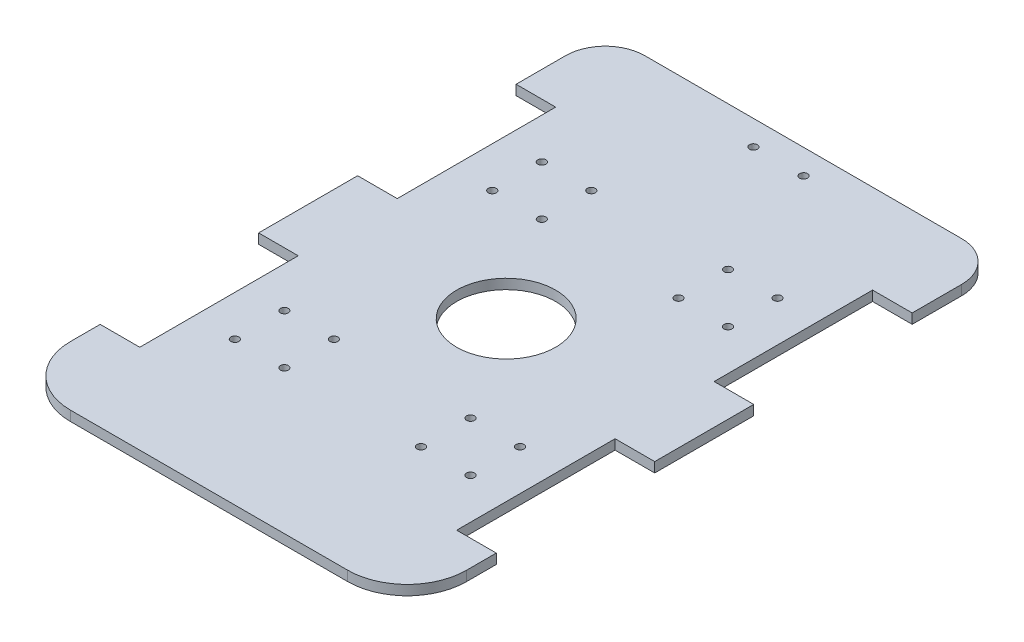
ISO-10303-21;
HEADER;
FILE_DESCRIPTION(('STEP AP214'),'2;1');
FILE_NAME('part.step','',(''),(''),'','','');
FILE_SCHEMA(('AUTOMOTIVE_DESIGN { 1 0 10303 214 1 1 1 1 }'));
ENDSEC;
DATA;
#1=APPLICATION_CONTEXT('core data for automotive mechanical design processes');
#2=APPLICATION_PROTOCOL_DEFINITION('international standard','automotive_design',2000,#1);
#3=PRODUCT_CONTEXT('',#1,'mechanical');
#4=PRODUCT('Part','Part','',(#3));
#5=PRODUCT_RELATED_PRODUCT_CATEGORY('part','',(#4));
#6=PRODUCT_DEFINITION_FORMATION('','',#4);
#7=PRODUCT_DEFINITION_CONTEXT('part definition',#1,'design');
#8=PRODUCT_DEFINITION('design','',#6,#7);
#9=PRODUCT_DEFINITION_SHAPE('','',#8);
#10=(LENGTH_UNIT() NAMED_UNIT(*) SI_UNIT(.MILLI.,.METRE.));
#11=(NAMED_UNIT(*) PLANE_ANGLE_UNIT() SI_UNIT($,.RADIAN.));
#12=(NAMED_UNIT(*) SI_UNIT($,.STERADIAN.) SOLID_ANGLE_UNIT());
#13=UNCERTAINTY_MEASURE_WITH_UNIT(LENGTH_MEASURE(1.E-05),#10,'distance_accuracy_value','');
#14=(GEOMETRIC_REPRESENTATION_CONTEXT(3) GLOBAL_UNCERTAINTY_ASSIGNED_CONTEXT((#13)) GLOBAL_UNIT_ASSIGNED_CONTEXT((#10,
#11,#12)) REPRESENTATION_CONTEXT('',''));
#15=CARTESIAN_POINT('',(0.,0.,0.));
#16=DIRECTION('',(0.,0.,1.));
#17=DIRECTION('',(1.,0.,0.));
#18=AXIS2_PLACEMENT_3D('',#15,#16,#17);
#19=CARTESIAN_POINT('',(70.,5.,120.));
#20=DIRECTION('',(0.,-1.,0.));
#21=DIRECTION('',(0.,0.,-1.));
#22=AXIS2_PLACEMENT_3D('',#19,#20,#21);
#23=PLANE('',#22);
#24=CARTESIAN_POINT('',(70.,5.,120.));
#25=DIRECTION('',(0.,1.,0.));
#26=DIRECTION('',(0.,0.,-1.));
#27=AXIS2_PLACEMENT_3D('',#24,#25,#26);
#28=CIRCLE('',#27,30.);
#29=CARTESIAN_POINT('',(70.0000000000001,5.,150.));
#30=VERTEX_POINT('',#29);
#31=CARTESIAN_POINT('',(100.,5.,120.));
#32=VERTEX_POINT('',#31);
#33=EDGE_CURVE('E274',#30,#32,#28,.T.);
#34=ORIENTED_EDGE('',*,*,#33,.T.);
#35=DIRECTION('',(0.,0.,-1.));
#36=VECTOR('',#35,1.);
#37=CARTESIAN_POINT('',(100.,5.,105.));
#38=LINE('',#37,#36);
#39=CARTESIAN_POINT('',(100.,5.,105.));
#40=VERTEX_POINT('',#39);
#41=EDGE_CURVE('E142',#32,#40,#38,.T.);
#42=ORIENTED_EDGE('',*,*,#41,.T.);
#43=DIRECTION('',(-1.,0.,0.));
#44=VECTOR('',#43,1.);
#45=CARTESIAN_POINT('',(80.,5.,105.));
#46=LINE('',#45,#44);
#47=CARTESIAN_POINT('',(80.,5.,105.));
#48=VERTEX_POINT('',#47);
#49=EDGE_CURVE('E337',#40,#48,#46,.T.);
#50=ORIENTED_EDGE('',*,*,#49,.T.);
#51=DIRECTION('',(0.,0.,-1.));
#52=VECTOR('',#51,1.);
#53=CARTESIAN_POINT('',(80.,5.,24.9999999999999));
#54=LINE('',#53,#52);
#55=CARTESIAN_POINT('',(80.,5.,24.9999999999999));
#56=VERTEX_POINT('',#55);
#57=EDGE_CURVE('E356',#48,#56,#54,.T.);
#58=ORIENTED_EDGE('',*,*,#57,.T.);
#59=DIRECTION('',(1.,0.,0.));
#60=VECTOR('',#59,1.);
#61=CARTESIAN_POINT('',(80.,5.,24.9999999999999));
#62=LINE('',#61,#60);
#63=CARTESIAN_POINT('',(100.,5.,24.9999999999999));
#64=VERTEX_POINT('',#63);
#65=EDGE_CURVE('E353',#56,#64,#62,.T.);
#66=ORIENTED_EDGE('',*,*,#65,.T.);
#67=DIRECTION('',(0.,0.,-1.));
#68=VECTOR('',#67,1.);
#69=CARTESIAN_POINT('',(100.,5.,-25.0000000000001));
#70=LINE('',#69,#68);
#71=CARTESIAN_POINT('',(100.,5.,-25.0000000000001));
#72=VERTEX_POINT('',#71);
#73=EDGE_CURVE('E355',#64,#72,#70,.T.);
#74=ORIENTED_EDGE('',*,*,#73,.T.);
#75=DIRECTION('',(-1.,0.,0.));
#76=VECTOR('',#75,1.);
#77=CARTESIAN_POINT('',(79.9999999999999,5.,-25.0000000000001));
#78=LINE('',#77,#76);
#79=CARTESIAN_POINT('',(79.9999999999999,5.,-25.0000000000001));
#80=VERTEX_POINT('',#79);
#81=EDGE_CURVE('E358',#72,#80,#78,.T.);
#82=ORIENTED_EDGE('',*,*,#81,.T.);
#83=DIRECTION('',(0.,0.,-1.));
#84=VECTOR('',#83,1.);
#85=CARTESIAN_POINT('',(79.9999999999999,5.,-105.));
#86=LINE('',#85,#84);
#87=CARTESIAN_POINT('',(79.9999999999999,5.,-105.));
#88=VERTEX_POINT('',#87);
#89=EDGE_CURVE('E364',#80,#88,#86,.T.);
#90=ORIENTED_EDGE('',*,*,#89,.T.);
#91=DIRECTION('',(1.,0.,0.));
#92=VECTOR('',#91,1.);
#93=CARTESIAN_POINT('',(79.9999999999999,5.,-105.));
#94=LINE('',#93,#92);
#95=CARTESIAN_POINT('',(100.,5.,-105.));
#96=VERTEX_POINT('',#95);
#97=EDGE_CURVE('E366',#88,#96,#94,.T.);
#98=ORIENTED_EDGE('',*,*,#97,.T.);
#99=DIRECTION('',(0.,0.,-1.));
#100=VECTOR('',#99,1.);
#101=CARTESIAN_POINT('',(100.,5.,-130.));
#102=LINE('',#101,#100);
#103=CARTESIAN_POINT('',(100.,5.,-130.));
#104=VERTEX_POINT('',#103);
#105=EDGE_CURVE('E368',#96,#104,#102,.T.);
#106=ORIENTED_EDGE('',*,*,#105,.T.);
#107=CARTESIAN_POINT('',(80.0000000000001,5.,-130.));
#108=DIRECTION('',(0.,1.,0.));
#109=DIRECTION('',(0.,0.,-1.));
#110=AXIS2_PLACEMENT_3D('',#107,#108,#109);
#111=CIRCLE('',#110,20.);
#112=CARTESIAN_POINT('',(80.0000000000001,5.,-150.));
#113=VERTEX_POINT('',#112);
#114=EDGE_CURVE('E370',#104,#113,#111,.T.);
#115=ORIENTED_EDGE('',*,*,#114,.T.);
#116=DIRECTION('',(-1.,0.,0.));
#117=VECTOR('',#116,1.);
#118=CARTESIAN_POINT('',(-80.0000000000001,5.,-150.));
#119=LINE('',#118,#117);
#120=CARTESIAN_POINT('',(-80.0000000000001,5.,-150.));
#121=VERTEX_POINT('',#120);
#122=EDGE_CURVE('E372',#113,#121,#119,.T.);
#123=ORIENTED_EDGE('',*,*,#122,.T.);
#124=CARTESIAN_POINT('',(-80.0000000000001,5.,-130.));
#125=DIRECTION('',(0.,1.,0.));
#126=DIRECTION('',(0.,0.,1.));
#127=AXIS2_PLACEMENT_3D('',#124,#125,#126);
#128=CIRCLE('',#127,20.);
#129=CARTESIAN_POINT('',(-100.,5.,-130.));
#130=VERTEX_POINT('',#129);
#131=EDGE_CURVE('E374',#121,#130,#128,.T.);
#132=ORIENTED_EDGE('',*,*,#131,.T.);
#133=DIRECTION('',(0.,0.,1.));
#134=VECTOR('',#133,1.);
#135=CARTESIAN_POINT('',(-100.,5.,-130.));
#136=LINE('',#135,#134);
#137=CARTESIAN_POINT('',(-100.,5.,-105.));
#138=VERTEX_POINT('',#137);
#139=EDGE_CURVE('E376',#130,#138,#136,.T.);
#140=ORIENTED_EDGE('',*,*,#139,.T.);
#141=DIRECTION('',(1.,0.,0.));
#142=VECTOR('',#141,1.);
#143=CARTESIAN_POINT('',(-79.9999999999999,5.,-105.));
#144=LINE('',#143,#142);
#145=CARTESIAN_POINT('',(-79.9999999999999,5.,-105.));
#146=VERTEX_POINT('',#145);
#147=EDGE_CURVE('E378',#138,#146,#144,.T.);
#148=ORIENTED_EDGE('',*,*,#147,.T.);
#149=DIRECTION('',(0.,0.,1.));
#150=VECTOR('',#149,1.);
#151=CARTESIAN_POINT('',(-79.9999999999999,5.,-105.));
#152=LINE('',#151,#150);
#153=CARTESIAN_POINT('',(-79.9999999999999,5.,-25.0000000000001));
#154=VERTEX_POINT('',#153);
#155=EDGE_CURVE('E380',#146,#154,#152,.T.);
#156=ORIENTED_EDGE('',*,*,#155,.T.);
#157=DIRECTION('',(-1.,0.,0.));
#158=VECTOR('',#157,1.);
#159=CARTESIAN_POINT('',(-79.9999999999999,5.,-25.0000000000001));
#160=LINE('',#159,#158);
#161=CARTESIAN_POINT('',(-100.,5.,-25.0000000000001));
#162=VERTEX_POINT('',#161);
#163=EDGE_CURVE('E382',#154,#162,#160,.T.);
#164=ORIENTED_EDGE('',*,*,#163,.T.);
#165=DIRECTION('',(0.,0.,1.));
#166=VECTOR('',#165,1.);
#167=CARTESIAN_POINT('',(-100.,5.,-25.0000000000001));
#168=LINE('',#167,#166);
#169=CARTESIAN_POINT('',(-100.,5.,24.9999999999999));
#170=VERTEX_POINT('',#169);
#171=EDGE_CURVE('E384',#162,#170,#168,.T.);
#172=ORIENTED_EDGE('',*,*,#171,.T.);
#173=DIRECTION('',(1.,0.,0.));
#174=VECTOR('',#173,1.);
#175=CARTESIAN_POINT('',(-80.,5.,24.9999999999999));
#176=LINE('',#175,#174);
#177=CARTESIAN_POINT('',(-80.,5.,24.9999999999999));
#178=VERTEX_POINT('',#177);
#179=EDGE_CURVE('E386',#170,#178,#176,.T.);
#180=ORIENTED_EDGE('',*,*,#179,.T.);
#181=DIRECTION('',(0.,0.,1.));
#182=VECTOR('',#181,1.);
#183=CARTESIAN_POINT('',(-80.,5.,24.9999999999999));
#184=LINE('',#183,#182);
#185=CARTESIAN_POINT('',(-80.,5.,105.));
#186=VERTEX_POINT('',#185);
#187=EDGE_CURVE('E388',#178,#186,#184,.T.);
#188=ORIENTED_EDGE('',*,*,#187,.T.);
#189=DIRECTION('',(-1.,0.,0.));
#190=VECTOR('',#189,1.);
#191=CARTESIAN_POINT('',(-80.,5.,105.));
#192=LINE('',#191,#190);
#193=CARTESIAN_POINT('',(-100.,5.,105.));
#194=VERTEX_POINT('',#193);
#195=EDGE_CURVE('E209',#186,#194,#192,.T.);
#196=ORIENTED_EDGE('',*,*,#195,.T.);
#197=DIRECTION('',(0.,0.,1.));
#198=VECTOR('',#197,1.);
#199=CARTESIAN_POINT('',(-100.,5.,105.));
#200=LINE('',#199,#198);
#201=CARTESIAN_POINT('',(-100.,5.,120.));
#202=VERTEX_POINT('',#201);
#203=EDGE_CURVE('E203',#194,#202,#200,.T.);
#204=ORIENTED_EDGE('',*,*,#203,.T.);
#205=CARTESIAN_POINT('',(-70.,5.,120.));
#206=DIRECTION('',(0.,1.,0.));
#207=DIRECTION('',(0.,0.,1.));
#208=AXIS2_PLACEMENT_3D('',#205,#206,#207);
#209=CIRCLE('',#208,30.);
#210=CARTESIAN_POINT('',(-70.,5.,150.));
#211=VERTEX_POINT('',#210);
#212=EDGE_CURVE('E207',#202,#211,#209,.T.);
#213=ORIENTED_EDGE('',*,*,#212,.T.);
#214=DIRECTION('',(1.,0.,0.));
#215=VECTOR('',#214,1.);
#216=CARTESIAN_POINT('',(-70.,5.,150.));
#217=LINE('',#216,#215);
#218=EDGE_CURVE('E51',#211,#30,#217,.T.);
#219=ORIENTED_EDGE('',*,*,#218,.T.);
#220=EDGE_LOOP('',(#34,#42,#50,#58,#66,#74,#82,#90,#98,#106,#115,#123,#132,#140,#148,#156,#164,
#172,#180,#188,#196,#204,#213,#219));
#221=FACE_BOUND('',#220,.T.);
#222=CARTESIAN_POINT('',(0.,5.,0.));
#223=DIRECTION('',(0.,1.,0.));
#224=DIRECTION('',(0.,0.,1.));
#225=AXIS2_PLACEMENT_3D('',#222,#223,#224);
#226=CIRCLE('',#225,25.);
#227=CARTESIAN_POINT('',(0.,5.,25.));
#228=VERTEX_POINT('',#227);
#229=EDGE_CURVE('E231',#228,#228,#226,.T.);
#230=ORIENTED_EDGE('',*,*,#229,.F.);
#231=EDGE_LOOP('',(#230));
#232=FACE_BOUND('',#231,.T.);
#233=CARTESIAN_POINT('',(-34.5,5.,-52.5));
#234=DIRECTION('',(0.,1.,0.));
#235=DIRECTION('',(0.,0.,1.));
#236=AXIS2_PLACEMENT_3D('',#233,#234,#235);
#237=CIRCLE('',#236,2.);
#238=CARTESIAN_POINT('',(-34.5,5.,-50.5));
#239=VERTEX_POINT('',#238);
#240=EDGE_CURVE('E602',#239,#239,#237,.T.);
#241=ORIENTED_EDGE('',*,*,#240,.F.);
#242=EDGE_LOOP('',(#241));
#243=FACE_BOUND('',#242,.T.);
#244=CARTESIAN_POINT('',(-59.5,5.,-52.5));
#245=DIRECTION('',(0.,1.,0.));
#246=DIRECTION('',(0.,0.,1.));
#247=AXIS2_PLACEMENT_3D('',#244,#245,#246);
#248=CIRCLE('',#247,2.);
#249=CARTESIAN_POINT('',(-59.5,5.,-50.5));
#250=VERTEX_POINT('',#249);
#251=EDGE_CURVE('E596',#250,#250,#248,.T.);
#252=ORIENTED_EDGE('',*,*,#251,.F.);
#253=EDGE_LOOP('',(#252));
#254=FACE_BOUND('',#253,.T.);
#255=CARTESIAN_POINT('',(-59.5,5.,-77.5));
#256=DIRECTION('',(0.,1.,0.));
#257=DIRECTION('',(0.,0.,1.));
#258=AXIS2_PLACEMENT_3D('',#255,#256,#257);
#259=CIRCLE('',#258,2.);
#260=CARTESIAN_POINT('',(-59.5,5.,-75.5));
#261=VERTEX_POINT('',#260);
#262=EDGE_CURVE('E590',#261,#261,#259,.T.);
#263=ORIENTED_EDGE('',*,*,#262,.F.);
#264=EDGE_LOOP('',(#263));
#265=FACE_BOUND('',#264,.T.);
#266=CARTESIAN_POINT('',(-34.5,5.,-77.5));
#267=DIRECTION('',(0.,1.,0.));
#268=DIRECTION('',(0.,0.,1.));
#269=AXIS2_PLACEMENT_3D('',#266,#267,#268);
#270=CIRCLE('',#269,2.);
#271=CARTESIAN_POINT('',(-34.5,5.,-75.5));
#272=VERTEX_POINT('',#271);
#273=EDGE_CURVE('E584',#272,#272,#270,.T.);
#274=ORIENTED_EDGE('',*,*,#273,.F.);
#275=EDGE_LOOP('',(#274));
#276=FACE_BOUND('',#275,.T.);
#277=CARTESIAN_POINT('',(-59.4999999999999,5.,77.5));
#278=DIRECTION('',(0.,1.,0.));
#279=DIRECTION('',(0.,0.,-1.));
#280=AXIS2_PLACEMENT_3D('',#277,#278,#279);
#281=CIRCLE('',#280,2.);
#282=CARTESIAN_POINT('',(-59.4999999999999,5.,75.5));
#283=VERTEX_POINT('',#282);
#284=EDGE_CURVE('E578',#283,#283,#281,.T.);
#285=ORIENTED_EDGE('',*,*,#284,.F.);
#286=EDGE_LOOP('',(#285));
#287=FACE_BOUND('',#286,.T.);
#288=CARTESIAN_POINT('',(-59.4999999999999,5.,52.5));
#289=DIRECTION('',(0.,1.,0.));
#290=DIRECTION('',(0.,0.,-1.));
#291=AXIS2_PLACEMENT_3D('',#288,#289,#290);
#292=CIRCLE('',#291,2.);
#293=CARTESIAN_POINT('',(-59.4999999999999,5.,50.5));
#294=VERTEX_POINT('',#293);
#295=EDGE_CURVE('E572',#294,#294,#292,.T.);
#296=ORIENTED_EDGE('',*,*,#295,.F.);
#297=EDGE_LOOP('',(#296));
#298=FACE_BOUND('',#297,.T.);
#299=CARTESIAN_POINT('',(-34.4999999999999,5.,52.5));
#300=DIRECTION('',(0.,1.,0.));
#301=DIRECTION('',(0.,0.,-1.));
#302=AXIS2_PLACEMENT_3D('',#299,#300,#301);
#303=CIRCLE('',#302,2.);
#304=CARTESIAN_POINT('',(-34.4999999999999,5.,50.5));
#305=VERTEX_POINT('',#304);
#306=EDGE_CURVE('E566',#305,#305,#303,.T.);
#307=ORIENTED_EDGE('',*,*,#306,.F.);
#308=EDGE_LOOP('',(#307));
#309=FACE_BOUND('',#308,.T.);
#310=CARTESIAN_POINT('',(-34.4999999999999,5.,77.5));
#311=DIRECTION('',(0.,1.,0.));
#312=DIRECTION('',(0.,0.,-1.));
#313=AXIS2_PLACEMENT_3D('',#310,#311,#312);
#314=CIRCLE('',#313,2.);
#315=CARTESIAN_POINT('',(-34.4999999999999,5.,75.5));
#316=VERTEX_POINT('',#315);
#317=EDGE_CURVE('E560',#316,#316,#314,.T.);
#318=ORIENTED_EDGE('',*,*,#317,.F.);
#319=EDGE_LOOP('',(#318));
#320=FACE_BOUND('',#319,.T.);
#321=CARTESIAN_POINT('',(59.5,5.,-77.5));
#322=DIRECTION('',(0.,1.,0.));
#323=DIRECTION('',(0.,0.,-1.));
#324=AXIS2_PLACEMENT_3D('',#321,#322,#323);
#325=CIRCLE('',#324,2.);
#326=CARTESIAN_POINT('',(59.5,5.,-79.5));
#327=VERTEX_POINT('',#326);
#328=EDGE_CURVE('E554',#327,#327,#325,.T.);
#329=ORIENTED_EDGE('',*,*,#328,.F.);
#330=EDGE_LOOP('',(#329));
#331=FACE_BOUND('',#330,.T.);
#332=CARTESIAN_POINT('',(59.5,5.,-52.5));
#333=DIRECTION('',(0.,1.,0.));
#334=DIRECTION('',(0.,0.,-1.));
#335=AXIS2_PLACEMENT_3D('',#332,#333,#334);
#336=CIRCLE('',#335,2.);
#337=CARTESIAN_POINT('',(59.5,5.,-54.5));
#338=VERTEX_POINT('',#337);
#339=EDGE_CURVE('E548',#338,#338,#336,.T.);
#340=ORIENTED_EDGE('',*,*,#339,.F.);
#341=EDGE_LOOP('',(#340));
#342=FACE_BOUND('',#341,.T.);
#343=CARTESIAN_POINT('',(34.5,5.,-77.5));
#344=DIRECTION('',(0.,1.,0.));
#345=DIRECTION('',(0.,0.,-1.));
#346=AXIS2_PLACEMENT_3D('',#343,#344,#345);
#347=CIRCLE('',#346,2.);
#348=CARTESIAN_POINT('',(34.5,5.,-79.5));
#349=VERTEX_POINT('',#348);
#350=EDGE_CURVE('E542',#349,#349,#347,.T.);
#351=ORIENTED_EDGE('',*,*,#350,.F.);
#352=EDGE_LOOP('',(#351));
#353=FACE_BOUND('',#352,.T.);
#354=CARTESIAN_POINT('',(34.5,5.,-52.5));
#355=DIRECTION('',(0.,1.,0.));
#356=DIRECTION('',(0.,0.,-1.));
#357=AXIS2_PLACEMENT_3D('',#354,#355,#356);
#358=CIRCLE('',#357,2.);
#359=CARTESIAN_POINT('',(34.5,5.,-54.5));
#360=VERTEX_POINT('',#359);
#361=EDGE_CURVE('E536',#360,#360,#358,.T.);
#362=ORIENTED_EDGE('',*,*,#361,.F.);
#363=EDGE_LOOP('',(#362));
#364=FACE_BOUND('',#363,.T.);
#365=CARTESIAN_POINT('',(59.4999999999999,5.,52.5));
#366=DIRECTION('',(0.,1.,0.));
#367=DIRECTION('',(0.,0.,1.));
#368=AXIS2_PLACEMENT_3D('',#365,#366,#367);
#369=CIRCLE('',#368,2.);
#370=CARTESIAN_POINT('',(59.4999999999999,5.,54.5));
#371=VERTEX_POINT('',#370);
#372=EDGE_CURVE('E530',#371,#371,#369,.T.);
#373=ORIENTED_EDGE('',*,*,#372,.F.);
#374=EDGE_LOOP('',(#373));
#375=FACE_BOUND('',#374,.T.);
#376=CARTESIAN_POINT('',(59.4999999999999,5.,77.5));
#377=DIRECTION('',(0.,1.,0.));
#378=DIRECTION('',(0.,0.,1.));
#379=AXIS2_PLACEMENT_3D('',#376,#377,#378);
#380=CIRCLE('',#379,2.);
#381=CARTESIAN_POINT('',(59.4999999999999,5.,79.5));
#382=VERTEX_POINT('',#381);
#383=EDGE_CURVE('E524',#382,#382,#380,.T.);
#384=ORIENTED_EDGE('',*,*,#383,.F.);
#385=EDGE_LOOP('',(#384));
#386=FACE_BOUND('',#385,.T.);
#387=CARTESIAN_POINT('',(34.4999999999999,5.,52.5));
#388=DIRECTION('',(0.,1.,0.));
#389=DIRECTION('',(0.,0.,1.));
#390=AXIS2_PLACEMENT_3D('',#387,#388,#389);
#391=CIRCLE('',#390,2.);
#392=CARTESIAN_POINT('',(34.4999999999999,5.,54.5));
#393=VERTEX_POINT('',#392);
#394=EDGE_CURVE('E518',#393,#393,#391,.T.);
#395=ORIENTED_EDGE('',*,*,#394,.F.);
#396=EDGE_LOOP('',(#395));
#397=FACE_BOUND('',#396,.T.);
#398=CARTESIAN_POINT('',(34.4999999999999,5.,77.5));
#399=DIRECTION('',(0.,1.,0.));
#400=DIRECTION('',(0.,0.,1.));
#401=AXIS2_PLACEMENT_3D('',#398,#399,#400);
#402=CIRCLE('',#401,2.);
#403=CARTESIAN_POINT('',(34.4999999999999,5.,79.5));
#404=VERTEX_POINT('',#403);
#405=EDGE_CURVE('E512',#404,#404,#402,.T.);
#406=ORIENTED_EDGE('',*,*,#405,.F.);
#407=EDGE_LOOP('',(#406));
#408=FACE_BOUND('',#407,.T.);
#409=CARTESIAN_POINT('',(12.656835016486,5.,-137.497440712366));
#410=DIRECTION('',(0.,1.,0.));
#411=DIRECTION('',(0.,0.,1.));
#412=AXIS2_PLACEMENT_3D('',#409,#410,#411);
#413=CIRCLE('',#412,2.);
#414=CARTESIAN_POINT('',(12.656835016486,5.,-135.497440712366));
#415=VERTEX_POINT('',#414);
#416=EDGE_CURVE('E506',#415,#415,#413,.T.);
#417=ORIENTED_EDGE('',*,*,#416,.F.);
#418=EDGE_LOOP('',(#417));
#419=FACE_BOUND('',#418,.T.);
#420=CARTESIAN_POINT('',(-12.656835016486,5.,-137.497440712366));
#421=DIRECTION('',(0.,1.,0.));
#422=DIRECTION('',(0.,0.,1.));
#423=AXIS2_PLACEMENT_3D('',#420,#421,#422);
#424=CIRCLE('',#423,2.);
#425=CARTESIAN_POINT('',(-12.656835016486,5.,-135.497440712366));
#426=VERTEX_POINT('',#425);
#427=EDGE_CURVE('E497',#426,#426,#424,.T.);
#428=ORIENTED_EDGE('',*,*,#427,.F.);
#429=EDGE_LOOP('',(#428));
#430=FACE_BOUND('',#429,.T.);
#431=ADVANCED_FACE('F34',(#221,#232,#243,#254,#265,#276,#287,#298,#309,#320,#331,#342,#353,#364,
#375,#386,#397,#408,#419,#430),#23,.F.);
#432=CARTESIAN_POINT('',(70.,0.,120.));
#433=DIRECTION('',(0.,-1.,0.));
#434=DIRECTION('',(0.,0.,-1.));
#435=AXIS2_PLACEMENT_3D('',#432,#433,#434);
#436=PLANE('',#435);
#437=CARTESIAN_POINT('',(12.656835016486,0.,-137.497440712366));
#438=DIRECTION('',(0.,1.,0.));
#439=DIRECTION('',(0.,0.,1.));
#440=AXIS2_PLACEMENT_3D('',#437,#438,#439);
#441=CIRCLE('',#440,2.);
#442=CARTESIAN_POINT('',(12.656835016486,0.,-135.497440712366));
#443=VERTEX_POINT('',#442);
#444=EDGE_CURVE('E503',#443,#443,#441,.T.);
#445=ORIENTED_EDGE('',*,*,#444,.T.);
#446=EDGE_LOOP('',(#445));
#447=FACE_BOUND('',#446,.T.);
#448=CARTESIAN_POINT('',(34.4999999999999,0.,52.5));
#449=DIRECTION('',(0.,1.,0.));
#450=DIRECTION('',(0.,0.,1.));
#451=AXIS2_PLACEMENT_3D('',#448,#449,#450);
#452=CIRCLE('',#451,2.);
#453=CARTESIAN_POINT('',(34.4999999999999,0.,54.5));
#454=VERTEX_POINT('',#453);
#455=EDGE_CURVE('E515',#454,#454,#452,.T.);
#456=ORIENTED_EDGE('',*,*,#455,.T.);
#457=EDGE_LOOP('',(#456));
#458=FACE_BOUND('',#457,.T.);
#459=CARTESIAN_POINT('',(59.4999999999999,0.,52.5));
#460=DIRECTION('',(0.,1.,0.));
#461=DIRECTION('',(0.,0.,1.));
#462=AXIS2_PLACEMENT_3D('',#459,#460,#461);
#463=CIRCLE('',#462,2.);
#464=CARTESIAN_POINT('',(59.4999999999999,0.,54.5));
#465=VERTEX_POINT('',#464);
#466=EDGE_CURVE('E527',#465,#465,#463,.T.);
#467=ORIENTED_EDGE('',*,*,#466,.T.);
#468=EDGE_LOOP('',(#467));
#469=FACE_BOUND('',#468,.T.);
#470=CARTESIAN_POINT('',(34.5,0.,-77.5));
#471=DIRECTION('',(0.,1.,0.));
#472=DIRECTION('',(0.,0.,-1.));
#473=AXIS2_PLACEMENT_3D('',#470,#471,#472);
#474=CIRCLE('',#473,2.);
#475=CARTESIAN_POINT('',(34.5,0.,-79.5));
#476=VERTEX_POINT('',#475);
#477=EDGE_CURVE('E539',#476,#476,#474,.T.);
#478=ORIENTED_EDGE('',*,*,#477,.T.);
#479=EDGE_LOOP('',(#478));
#480=FACE_BOUND('',#479,.T.);
#481=CARTESIAN_POINT('',(59.5,0.,-77.5));
#482=DIRECTION('',(0.,1.,0.));
#483=DIRECTION('',(0.,0.,-1.));
#484=AXIS2_PLACEMENT_3D('',#481,#482,#483);
#485=CIRCLE('',#484,2.);
#486=CARTESIAN_POINT('',(59.5,0.,-79.5));
#487=VERTEX_POINT('',#486);
#488=EDGE_CURVE('E551',#487,#487,#485,.T.);
#489=ORIENTED_EDGE('',*,*,#488,.T.);
#490=EDGE_LOOP('',(#489));
#491=FACE_BOUND('',#490,.T.);
#492=CARTESIAN_POINT('',(-34.4999999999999,0.,52.5));
#493=DIRECTION('',(0.,1.,0.));
#494=DIRECTION('',(0.,0.,-1.));
#495=AXIS2_PLACEMENT_3D('',#492,#493,#494);
#496=CIRCLE('',#495,2.);
#497=CARTESIAN_POINT('',(-34.4999999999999,0.,50.5));
#498=VERTEX_POINT('',#497);
#499=EDGE_CURVE('E563',#498,#498,#496,.T.);
#500=ORIENTED_EDGE('',*,*,#499,.T.);
#501=EDGE_LOOP('',(#500));
#502=FACE_BOUND('',#501,.T.);
#503=CARTESIAN_POINT('',(-59.4999999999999,0.,77.5));
#504=DIRECTION('',(0.,1.,0.));
#505=DIRECTION('',(0.,0.,-1.));
#506=AXIS2_PLACEMENT_3D('',#503,#504,#505);
#507=CIRCLE('',#506,2.);
#508=CARTESIAN_POINT('',(-59.4999999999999,0.,75.5));
#509=VERTEX_POINT('',#508);
#510=EDGE_CURVE('E575',#509,#509,#507,.T.);
#511=ORIENTED_EDGE('',*,*,#510,.T.);
#512=EDGE_LOOP('',(#511));
#513=FACE_BOUND('',#512,.T.);
#514=CARTESIAN_POINT('',(-59.5,0.,-77.5));
#515=DIRECTION('',(0.,1.,0.));
#516=DIRECTION('',(0.,0.,1.));
#517=AXIS2_PLACEMENT_3D('',#514,#515,#516);
#518=CIRCLE('',#517,2.);
#519=CARTESIAN_POINT('',(-59.5,0.,-75.5));
#520=VERTEX_POINT('',#519);
#521=EDGE_CURVE('E587',#520,#520,#518,.T.);
#522=ORIENTED_EDGE('',*,*,#521,.T.);
#523=EDGE_LOOP('',(#522));
#524=FACE_BOUND('',#523,.T.);
#525=CARTESIAN_POINT('',(-34.5,0.,-52.5));
#526=DIRECTION('',(0.,1.,0.));
#527=DIRECTION('',(0.,0.,1.));
#528=AXIS2_PLACEMENT_3D('',#525,#526,#527);
#529=CIRCLE('',#528,2.);
#530=CARTESIAN_POINT('',(-34.5,0.,-50.5));
#531=VERTEX_POINT('',#530);
#532=EDGE_CURVE('E599',#531,#531,#529,.T.);
#533=ORIENTED_EDGE('',*,*,#532,.T.);
#534=EDGE_LOOP('',(#533));
#535=FACE_BOUND('',#534,.T.);
#536=CARTESIAN_POINT('',(70.,0.,120.));
#537=DIRECTION('',(0.,1.,0.));
#538=DIRECTION('',(0.,0.,-1.));
#539=AXIS2_PLACEMENT_3D('',#536,#537,#538);
#540=CIRCLE('',#539,30.);
#541=CARTESIAN_POINT('',(70.0000000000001,0.,150.));
#542=VERTEX_POINT('',#541);
#543=CARTESIAN_POINT('',(100.,0.,120.));
#544=VERTEX_POINT('',#543);
#545=EDGE_CURVE('E227',#542,#544,#540,.T.);
#546=ORIENTED_EDGE('',*,*,#545,.F.);
#547=DIRECTION('',(1.,0.,0.));
#548=VECTOR('',#547,1.);
#549=CARTESIAN_POINT('',(-70.,0.,150.));
#550=LINE('',#549,#548);
#551=CARTESIAN_POINT('',(-70.,0.,150.));
#552=VERTEX_POINT('',#551);
#553=EDGE_CURVE('E134',#552,#542,#550,.T.);
#554=ORIENTED_EDGE('',*,*,#553,.F.);
#555=CARTESIAN_POINT('',(-70.,0.,120.));
#556=DIRECTION('',(0.,1.,0.));
#557=DIRECTION('',(0.,0.,1.));
#558=AXIS2_PLACEMENT_3D('',#555,#556,#557);
#559=CIRCLE('',#558,30.);
#560=CARTESIAN_POINT('',(-100.,0.,120.));
#561=VERTEX_POINT('',#560);
#562=EDGE_CURVE('E128',#561,#552,#559,.T.);
#563=ORIENTED_EDGE('',*,*,#562,.F.);
#564=DIRECTION('',(0.,0.,1.));
#565=VECTOR('',#564,1.);
#566=CARTESIAN_POINT('',(-100.,0.,105.));
#567=LINE('',#566,#565);
#568=CARTESIAN_POINT('',(-100.,0.,105.));
#569=VERTEX_POINT('',#568);
#570=EDGE_CURVE('E217',#569,#561,#567,.T.);
#571=ORIENTED_EDGE('',*,*,#570,.F.);
#572=DIRECTION('',(-1.,0.,0.));
#573=VECTOR('',#572,1.);
#574=CARTESIAN_POINT('',(-80.,0.,105.));
#575=LINE('',#574,#573);
#576=CARTESIAN_POINT('',(-80.,0.,105.));
#577=VERTEX_POINT('',#576);
#578=EDGE_CURVE('E269',#577,#569,#575,.T.);
#579=ORIENTED_EDGE('',*,*,#578,.F.);
#580=DIRECTION('',(0.,0.,1.));
#581=VECTOR('',#580,1.);
#582=CARTESIAN_POINT('',(-80.,0.,24.9999999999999));
#583=LINE('',#582,#581);
#584=CARTESIAN_POINT('',(-80.,0.,24.9999999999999));
#585=VERTEX_POINT('',#584);
#586=EDGE_CURVE('E267',#585,#577,#583,.T.);
#587=ORIENTED_EDGE('',*,*,#586,.F.);
#588=DIRECTION('',(1.,0.,0.));
#589=VECTOR('',#588,1.);
#590=CARTESIAN_POINT('',(-80.,0.,24.9999999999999));
#591=LINE('',#590,#589);
#592=CARTESIAN_POINT('',(-100.,0.,24.9999999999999));
#593=VERTEX_POINT('',#592);
#594=EDGE_CURVE('E265',#593,#585,#591,.T.);
#595=ORIENTED_EDGE('',*,*,#594,.F.);
#596=DIRECTION('',(0.,0.,1.));
#597=VECTOR('',#596,1.);
#598=CARTESIAN_POINT('',(-100.,0.,-25.0000000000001));
#599=LINE('',#598,#597);
#600=CARTESIAN_POINT('',(-100.,0.,-25.0000000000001));
#601=VERTEX_POINT('',#600);
#602=EDGE_CURVE('E263',#601,#593,#599,.T.);
#603=ORIENTED_EDGE('',*,*,#602,.F.);
#604=DIRECTION('',(-1.,0.,0.));
#605=VECTOR('',#604,1.);
#606=CARTESIAN_POINT('',(-79.9999999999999,0.,-25.0000000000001));
#607=LINE('',#606,#605);
#608=CARTESIAN_POINT('',(-79.9999999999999,0.,-25.0000000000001));
#609=VERTEX_POINT('',#608);
#610=EDGE_CURVE('E261',#609,#601,#607,.T.);
#611=ORIENTED_EDGE('',*,*,#610,.F.);
#612=DIRECTION('',(0.,0.,1.));
#613=VECTOR('',#612,1.);
#614=CARTESIAN_POINT('',(-79.9999999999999,0.,-105.));
#615=LINE('',#614,#613);
#616=CARTESIAN_POINT('',(-79.9999999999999,0.,-105.));
#617=VERTEX_POINT('',#616);
#618=EDGE_CURVE('E259',#617,#609,#615,.T.);
#619=ORIENTED_EDGE('',*,*,#618,.F.);
#620=DIRECTION('',(1.,0.,0.));
#621=VECTOR('',#620,1.);
#622=CARTESIAN_POINT('',(-79.9999999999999,0.,-105.));
#623=LINE('',#622,#621);
#624=CARTESIAN_POINT('',(-100.,0.,-105.));
#625=VERTEX_POINT('',#624);
#626=EDGE_CURVE('E257',#625,#617,#623,.T.);
#627=ORIENTED_EDGE('',*,*,#626,.F.);
#628=DIRECTION('',(0.,0.,1.));
#629=VECTOR('',#628,1.);
#630=CARTESIAN_POINT('',(-100.,0.,-130.));
#631=LINE('',#630,#629);
#632=CARTESIAN_POINT('',(-100.,0.,-130.));
#633=VERTEX_POINT('',#632);
#634=EDGE_CURVE('E255',#633,#625,#631,.T.);
#635=ORIENTED_EDGE('',*,*,#634,.F.);
#636=CARTESIAN_POINT('',(-80.0000000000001,0.,-130.));
#637=DIRECTION('',(0.,1.,0.));
#638=DIRECTION('',(0.,0.,1.));
#639=AXIS2_PLACEMENT_3D('',#636,#637,#638);
#640=CIRCLE('',#639,20.);
#641=CARTESIAN_POINT('',(-80.0000000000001,0.,-150.));
#642=VERTEX_POINT('',#641);
#643=EDGE_CURVE('E253',#642,#633,#640,.T.);
#644=ORIENTED_EDGE('',*,*,#643,.F.);
#645=DIRECTION('',(-1.,0.,0.));
#646=VECTOR('',#645,1.);
#647=CARTESIAN_POINT('',(-80.0000000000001,0.,-150.));
#648=LINE('',#647,#646);
#649=CARTESIAN_POINT('',(80.0000000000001,0.,-150.));
#650=VERTEX_POINT('',#649);
#651=EDGE_CURVE('E251',#650,#642,#648,.T.);
#652=ORIENTED_EDGE('',*,*,#651,.F.);
#653=CARTESIAN_POINT('',(80.0000000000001,0.,-130.));
#654=DIRECTION('',(0.,1.,0.));
#655=DIRECTION('',(0.,0.,-1.));
#656=AXIS2_PLACEMENT_3D('',#653,#654,#655);
#657=CIRCLE('',#656,20.);
#658=CARTESIAN_POINT('',(100.,0.,-130.));
#659=VERTEX_POINT('',#658);
#660=EDGE_CURVE('E249',#659,#650,#657,.T.);
#661=ORIENTED_EDGE('',*,*,#660,.F.);
#662=DIRECTION('',(0.,0.,-1.));
#663=VECTOR('',#662,1.);
#664=CARTESIAN_POINT('',(100.,0.,-130.));
#665=LINE('',#664,#663);
#666=CARTESIAN_POINT('',(100.,0.,-105.));
#667=VERTEX_POINT('',#666);
#668=EDGE_CURVE('E247',#667,#659,#665,.T.);
#669=ORIENTED_EDGE('',*,*,#668,.F.);
#670=DIRECTION('',(1.,0.,0.));
#671=VECTOR('',#670,1.);
#672=CARTESIAN_POINT('',(79.9999999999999,0.,-105.));
#673=LINE('',#672,#671);
#674=CARTESIAN_POINT('',(79.9999999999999,0.,-105.));
#675=VERTEX_POINT('',#674);
#676=EDGE_CURVE('E245',#675,#667,#673,.T.);
#677=ORIENTED_EDGE('',*,*,#676,.F.);
#678=DIRECTION('',(0.,0.,-1.));
#679=VECTOR('',#678,1.);
#680=CARTESIAN_POINT('',(79.9999999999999,0.,-105.));
#681=LINE('',#680,#679);
#682=CARTESIAN_POINT('',(79.9999999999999,0.,-25.0000000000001));
#683=VERTEX_POINT('',#682);
#684=EDGE_CURVE('E243',#683,#675,#681,.T.);
#685=ORIENTED_EDGE('',*,*,#684,.F.);
#686=DIRECTION('',(-1.,0.,0.));
#687=VECTOR('',#686,1.);
#688=CARTESIAN_POINT('',(79.9999999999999,0.,-25.0000000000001));
#689=LINE('',#688,#687);
#690=CARTESIAN_POINT('',(100.,0.,-25.0000000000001));
#691=VERTEX_POINT('',#690);
#692=EDGE_CURVE('E241',#691,#683,#689,.T.);
#693=ORIENTED_EDGE('',*,*,#692,.F.);
#694=DIRECTION('',(0.,0.,-1.));
#695=VECTOR('',#694,1.);
#696=CARTESIAN_POINT('',(100.,0.,-25.0000000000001));
#697=LINE('',#696,#695);
#698=CARTESIAN_POINT('',(100.,0.,24.9999999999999));
#699=VERTEX_POINT('',#698);
#700=EDGE_CURVE('E239',#699,#691,#697,.T.);
#701=ORIENTED_EDGE('',*,*,#700,.F.);
#702=DIRECTION('',(1.,0.,0.));
#703=VECTOR('',#702,1.);
#704=CARTESIAN_POINT('',(80.,0.,24.9999999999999));
#705=LINE('',#704,#703);
#706=CARTESIAN_POINT('',(80.,0.,24.9999999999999));
#707=VERTEX_POINT('',#706);
#708=EDGE_CURVE('E237',#707,#699,#705,.T.);
#709=ORIENTED_EDGE('',*,*,#708,.F.);
#710=DIRECTION('',(0.,0.,-1.));
#711=VECTOR('',#710,1.);
#712=CARTESIAN_POINT('',(80.,0.,24.9999999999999));
#713=LINE('',#712,#711);
#714=CARTESIAN_POINT('',(80.,0.,105.));
#715=VERTEX_POINT('',#714);
#716=EDGE_CURVE('E235',#715,#707,#713,.T.);
#717=ORIENTED_EDGE('',*,*,#716,.F.);
#718=DIRECTION('',(-1.,0.,0.));
#719=VECTOR('',#718,1.);
#720=CARTESIAN_POINT('',(80.,0.,105.));
#721=LINE('',#720,#719);
#722=CARTESIAN_POINT('',(100.,0.,105.));
#723=VERTEX_POINT('',#722);
#724=EDGE_CURVE('E233',#723,#715,#721,.T.);
#725=ORIENTED_EDGE('',*,*,#724,.F.);
#726=DIRECTION('',(0.,0.,-1.));
#727=VECTOR('',#726,1.);
#728=CARTESIAN_POINT('',(100.,0.,105.));
#729=LINE('',#728,#727);
#730=EDGE_CURVE('E230',#544,#723,#729,.T.);
#731=ORIENTED_EDGE('',*,*,#730,.F.);
#732=EDGE_LOOP('',(#546,#554,#563,#571,#579,#587,#595,#603,#611,#619,#627,#635,#644,#652,#661,
#669,#677,#685,#693,#701,#709,#717,#725,#731));
#733=FACE_BOUND('',#732,.T.);
#734=CARTESIAN_POINT('',(0.,0.,0.));
#735=DIRECTION('',(0.,1.,0.));
#736=DIRECTION('',(0.,0.,1.));
#737=AXIS2_PLACEMENT_3D('',#734,#735,#736);
#738=CIRCLE('',#737,25.);
#739=CARTESIAN_POINT('',(0.,0.,25.));
#740=VERTEX_POINT('',#739);
#741=EDGE_CURVE('E605',#740,#740,#738,.T.);
#742=ORIENTED_EDGE('',*,*,#741,.T.);
#743=EDGE_LOOP('',(#742));
#744=FACE_BOUND('',#743,.T.);
#745=CARTESIAN_POINT('',(-59.5,0.,-52.5));
#746=DIRECTION('',(0.,1.,0.));
#747=DIRECTION('',(0.,0.,1.));
#748=AXIS2_PLACEMENT_3D('',#745,#746,#747);
#749=CIRCLE('',#748,2.);
#750=CARTESIAN_POINT('',(-59.5,0.,-50.5));
#751=VERTEX_POINT('',#750);
#752=EDGE_CURVE('E593',#751,#751,#749,.T.);
#753=ORIENTED_EDGE('',*,*,#752,.T.);
#754=EDGE_LOOP('',(#753));
#755=FACE_BOUND('',#754,.T.);
#756=CARTESIAN_POINT('',(-34.5,0.,-77.5));
#757=DIRECTION('',(0.,1.,0.));
#758=DIRECTION('',(0.,0.,1.));
#759=AXIS2_PLACEMENT_3D('',#756,#757,#758);
#760=CIRCLE('',#759,2.);
#761=CARTESIAN_POINT('',(-34.5,0.,-75.5));
#762=VERTEX_POINT('',#761);
#763=EDGE_CURVE('E581',#762,#762,#760,.T.);
#764=ORIENTED_EDGE('',*,*,#763,.T.);
#765=EDGE_LOOP('',(#764));
#766=FACE_BOUND('',#765,.T.);
#767=CARTESIAN_POINT('',(-59.4999999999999,0.,52.5));
#768=DIRECTION('',(0.,1.,0.));
#769=DIRECTION('',(0.,0.,-1.));
#770=AXIS2_PLACEMENT_3D('',#767,#768,#769);
#771=CIRCLE('',#770,2.);
#772=CARTESIAN_POINT('',(-59.4999999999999,0.,50.5));
#773=VERTEX_POINT('',#772);
#774=EDGE_CURVE('E569',#773,#773,#771,.T.);
#775=ORIENTED_EDGE('',*,*,#774,.T.);
#776=EDGE_LOOP('',(#775));
#777=FACE_BOUND('',#776,.T.);
#778=CARTESIAN_POINT('',(-34.4999999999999,0.,77.5));
#779=DIRECTION('',(0.,1.,0.));
#780=DIRECTION('',(0.,0.,-1.));
#781=AXIS2_PLACEMENT_3D('',#778,#779,#780);
#782=CIRCLE('',#781,2.);
#783=CARTESIAN_POINT('',(-34.4999999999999,0.,75.5));
#784=VERTEX_POINT('',#783);
#785=EDGE_CURVE('E557',#784,#784,#782,.T.);
#786=ORIENTED_EDGE('',*,*,#785,.T.);
#787=EDGE_LOOP('',(#786));
#788=FACE_BOUND('',#787,.T.);
#789=CARTESIAN_POINT('',(59.5,0.,-52.5));
#790=DIRECTION('',(0.,1.,0.));
#791=DIRECTION('',(0.,0.,-1.));
#792=AXIS2_PLACEMENT_3D('',#789,#790,#791);
#793=CIRCLE('',#792,2.);
#794=CARTESIAN_POINT('',(59.5,0.,-54.5));
#795=VERTEX_POINT('',#794);
#796=EDGE_CURVE('E545',#795,#795,#793,.T.);
#797=ORIENTED_EDGE('',*,*,#796,.T.);
#798=EDGE_LOOP('',(#797));
#799=FACE_BOUND('',#798,.T.);
#800=CARTESIAN_POINT('',(34.5,0.,-52.5));
#801=DIRECTION('',(0.,1.,0.));
#802=DIRECTION('',(0.,0.,-1.));
#803=AXIS2_PLACEMENT_3D('',#800,#801,#802);
#804=CIRCLE('',#803,2.);
#805=CARTESIAN_POINT('',(34.5,0.,-54.5));
#806=VERTEX_POINT('',#805);
#807=EDGE_CURVE('E533',#806,#806,#804,.T.);
#808=ORIENTED_EDGE('',*,*,#807,.T.);
#809=EDGE_LOOP('',(#808));
#810=FACE_BOUND('',#809,.T.);
#811=CARTESIAN_POINT('',(59.4999999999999,0.,77.5));
#812=DIRECTION('',(0.,1.,0.));
#813=DIRECTION('',(0.,0.,1.));
#814=AXIS2_PLACEMENT_3D('',#811,#812,#813);
#815=CIRCLE('',#814,2.);
#816=CARTESIAN_POINT('',(59.4999999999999,0.,79.5));
#817=VERTEX_POINT('',#816);
#818=EDGE_CURVE('E521',#817,#817,#815,.T.);
#819=ORIENTED_EDGE('',*,*,#818,.T.);
#820=EDGE_LOOP('',(#819));
#821=FACE_BOUND('',#820,.T.);
#822=CARTESIAN_POINT('',(34.4999999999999,0.,77.5));
#823=DIRECTION('',(0.,1.,0.));
#824=DIRECTION('',(0.,0.,1.));
#825=AXIS2_PLACEMENT_3D('',#822,#823,#824);
#826=CIRCLE('',#825,2.);
#827=CARTESIAN_POINT('',(34.4999999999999,0.,79.5));
#828=VERTEX_POINT('',#827);
#829=EDGE_CURVE('E509',#828,#828,#826,.T.);
#830=ORIENTED_EDGE('',*,*,#829,.T.);
#831=EDGE_LOOP('',(#830));
#832=FACE_BOUND('',#831,.T.);
#833=CARTESIAN_POINT('',(-12.656835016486,0.,-137.497440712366));
#834=DIRECTION('',(0.,1.,0.));
#835=DIRECTION('',(0.,0.,1.));
#836=AXIS2_PLACEMENT_3D('',#833,#834,#835);
#837=CIRCLE('',#836,2.);
#838=CARTESIAN_POINT('',(-12.656835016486,0.,-135.497440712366));
#839=VERTEX_POINT('',#838);
#840=EDGE_CURVE('E500',#839,#839,#837,.T.);
#841=ORIENTED_EDGE('',*,*,#840,.T.);
#842=EDGE_LOOP('',(#841));
#843=FACE_BOUND('',#842,.T.);
#844=ADVANCED_FACE('F341',(#447,#458,#469,#480,#491,#502,#513,#524,#535,#733,#744,#755,#766,
#777,#788,#799,#810,#821,#832,#843),#436,.T.);
#845=CARTESIAN_POINT('',(70.,5.,120.));
#846=DIRECTION('',(0.,-1.,0.));
#847=DIRECTION('',(0.,0.,-1.));
#848=AXIS2_PLACEMENT_3D('',#845,#846,#847);
#849=CYLINDRICAL_SURFACE('',#848,30.);
#850=ORIENTED_EDGE('',*,*,#545,.T.);
#851=DIRECTION('',(0.,-1.,0.));
#852=VECTOR('',#851,1.);
#853=CARTESIAN_POINT('',(100.,5.,120.));
#854=LINE('',#853,#852);
#855=EDGE_CURVE('E11',#32,#544,#854,.T.);
#856=ORIENTED_EDGE('',*,*,#855,.F.);
#857=ORIENTED_EDGE('',*,*,#33,.F.);
#858=DIRECTION('',(0.,-1.,0.));
#859=VECTOR('',#858,1.);
#860=CARTESIAN_POINT('',(70.0000000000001,5.,150.));
#861=LINE('',#860,#859);
#862=EDGE_CURVE('E223',#30,#542,#861,.T.);
#863=ORIENTED_EDGE('',*,*,#862,.T.);
#864=EDGE_LOOP('',(#850,#856,#857,#863));
#865=FACE_BOUND('',#864,.T.);
#866=ADVANCED_FACE('F36',(#865),#849,.T.);
#867=CARTESIAN_POINT('',(100.,5.,105.));
#868=DIRECTION('',(-1.,0.,0.));
#869=DIRECTION('',(0.,0.,1.));
#870=AXIS2_PLACEMENT_3D('',#867,#868,#869);
#871=PLANE('',#870);
#872=ORIENTED_EDGE('',*,*,#730,.T.);
#873=DIRECTION('',(0.,-1.,0.));
#874=VECTOR('',#873,1.);
#875=CARTESIAN_POINT('',(100.,5.,105.));
#876=LINE('',#875,#874);
#877=EDGE_CURVE('E43',#40,#723,#876,.T.);
#878=ORIENTED_EDGE('',*,*,#877,.F.);
#879=ORIENTED_EDGE('',*,*,#41,.F.);
#880=ORIENTED_EDGE('',*,*,#855,.T.);
#881=EDGE_LOOP('',(#872,#878,#879,#880));
#882=FACE_BOUND('',#881,.T.);
#883=ADVANCED_FACE('F972',(#882),#871,.F.);
#884=CARTESIAN_POINT('',(80.,5.,105.));
#885=DIRECTION('',(0.,0.,1.));
#886=DIRECTION('',(1.,0.,0.));
#887=AXIS2_PLACEMENT_3D('',#884,#885,#886);
#888=PLANE('',#887);
#889=ORIENTED_EDGE('',*,*,#724,.T.);
#890=DIRECTION('',(0.,-1.,0.));
#891=VECTOR('',#890,1.);
#892=CARTESIAN_POINT('',(80.,5.,105.));
#893=LINE('',#892,#891);
#894=EDGE_CURVE('E329',#48,#715,#893,.T.);
#895=ORIENTED_EDGE('',*,*,#894,.F.);
#896=ORIENTED_EDGE('',*,*,#49,.F.);
#897=ORIENTED_EDGE('',*,*,#877,.T.);
#898=EDGE_LOOP('',(#889,#895,#896,#897));
#899=FACE_BOUND('',#898,.T.);
#900=ADVANCED_FACE('F335',(#899),#888,.F.);
#901=CARTESIAN_POINT('',(80.,5.,24.9999999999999));
#902=DIRECTION('',(-1.,0.,0.));
#903=DIRECTION('',(0.,0.,1.));
#904=AXIS2_PLACEMENT_3D('',#901,#902,#903);
#905=PLANE('',#904);
#906=ORIENTED_EDGE('',*,*,#716,.T.);
#907=DIRECTION('',(0.,-1.,0.));
#908=VECTOR('',#907,1.);
#909=CARTESIAN_POINT('',(80.,5.,24.9999999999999));
#910=LINE('',#909,#908);
#911=EDGE_CURVE('E326',#56,#707,#910,.T.);
#912=ORIENTED_EDGE('',*,*,#911,.F.);
#913=ORIENTED_EDGE('',*,*,#57,.F.);
#914=ORIENTED_EDGE('',*,*,#894,.T.);
#915=EDGE_LOOP('',(#906,#912,#913,#914));
#916=FACE_BOUND('',#915,.T.);
#917=ADVANCED_FACE('F347',(#916),#905,.F.);
#918=CARTESIAN_POINT('',(80.,5.,24.9999999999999));
#919=DIRECTION('',(0.,0.,-1.));
#920=DIRECTION('',(-1.,0.,0.));
#921=AXIS2_PLACEMENT_3D('',#918,#919,#920);
#922=PLANE('',#921);
#923=ORIENTED_EDGE('',*,*,#708,.T.);
#924=DIRECTION('',(0.,-1.,0.));
#925=VECTOR('',#924,1.);
#926=CARTESIAN_POINT('',(100.,5.,24.9999999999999));
#927=LINE('',#926,#925);
#928=EDGE_CURVE('E323',#64,#699,#927,.T.);
#929=ORIENTED_EDGE('',*,*,#928,.F.);
#930=ORIENTED_EDGE('',*,*,#65,.F.);
#931=ORIENTED_EDGE('',*,*,#911,.T.);
#932=EDGE_LOOP('',(#923,#929,#930,#931));
#933=FACE_BOUND('',#932,.T.);
#934=ADVANCED_FACE('F351',(#933),#922,.F.);
#935=CARTESIAN_POINT('',(100.,5.,-25.0000000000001));
#936=DIRECTION('',(-1.,0.,0.));
#937=DIRECTION('',(0.,0.,1.));
#938=AXIS2_PLACEMENT_3D('',#935,#936,#937);
#939=PLANE('',#938);
#940=ORIENTED_EDGE('',*,*,#700,.T.);
#941=DIRECTION('',(0.,-1.,0.));
#942=VECTOR('',#941,1.);
#943=CARTESIAN_POINT('',(100.,5.,-25.0000000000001));
#944=LINE('',#943,#942);
#945=EDGE_CURVE('E320',#72,#691,#944,.T.);
#946=ORIENTED_EDGE('',*,*,#945,.F.);
#947=ORIENTED_EDGE('',*,*,#73,.F.);
#948=ORIENTED_EDGE('',*,*,#928,.T.);
#949=EDGE_LOOP('',(#940,#946,#947,#948));
#950=FACE_BOUND('',#949,.T.);
#951=ADVANCED_FACE('F937',(#950),#939,.F.);
#952=CARTESIAN_POINT('',(79.9999999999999,5.,-25.0000000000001));
#953=DIRECTION('',(0.,0.,1.));
#954=DIRECTION('',(1.,0.,0.));
#955=AXIS2_PLACEMENT_3D('',#952,#953,#954);
#956=PLANE('',#955);
#957=ORIENTED_EDGE('',*,*,#692,.T.);
#958=DIRECTION('',(0.,-1.,0.));
#959=VECTOR('',#958,1.);
#960=CARTESIAN_POINT('',(79.9999999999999,5.,-25.0000000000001));
#961=LINE('',#960,#959);
#962=EDGE_CURVE('E317',#80,#683,#961,.T.);
#963=ORIENTED_EDGE('',*,*,#962,.F.);
#964=ORIENTED_EDGE('',*,*,#81,.F.);
#965=ORIENTED_EDGE('',*,*,#945,.T.);
#966=EDGE_LOOP('',(#957,#963,#964,#965));
#967=FACE_BOUND('',#966,.T.);
#968=ADVANCED_FACE('F927',(#967),#956,.F.);
#969=CARTESIAN_POINT('',(79.9999999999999,5.,-105.));
#970=DIRECTION('',(-1.,0.,0.));
#971=DIRECTION('',(0.,0.,1.));
#972=AXIS2_PLACEMENT_3D('',#969,#970,#971);
#973=PLANE('',#972);
#974=ORIENTED_EDGE('',*,*,#684,.T.);
#975=DIRECTION('',(0.,-1.,0.));
#976=VECTOR('',#975,1.);
#977=CARTESIAN_POINT('',(79.9999999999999,5.,-105.));
#978=LINE('',#977,#976);
#979=EDGE_CURVE('E314',#88,#675,#978,.T.);
#980=ORIENTED_EDGE('',*,*,#979,.F.);
#981=ORIENTED_EDGE('',*,*,#89,.F.);
#982=ORIENTED_EDGE('',*,*,#962,.T.);
#983=EDGE_LOOP('',(#974,#980,#981,#982));
#984=FACE_BOUND('',#983,.T.);
#985=ADVANCED_FACE('F917',(#984),#973,.F.);
#986=CARTESIAN_POINT('',(79.9999999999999,5.,-105.));
#987=DIRECTION('',(0.,0.,-1.));
#988=DIRECTION('',(-1.,0.,0.));
#989=AXIS2_PLACEMENT_3D('',#986,#987,#988);
#990=PLANE('',#989);
#991=ORIENTED_EDGE('',*,*,#676,.T.);
#992=DIRECTION('',(0.,-1.,0.));
#993=VECTOR('',#992,1.);
#994=CARTESIAN_POINT('',(100.,5.,-105.));
#995=LINE('',#994,#993);
#996=EDGE_CURVE('E311',#96,#667,#995,.T.);
#997=ORIENTED_EDGE('',*,*,#996,.F.);
#998=ORIENTED_EDGE('',*,*,#97,.F.);
#999=ORIENTED_EDGE('',*,*,#979,.T.);
#1000=EDGE_LOOP('',(#991,#997,#998,#999));
#1001=FACE_BOUND('',#1000,.T.);
#1002=ADVANCED_FACE('F907',(#1001),#990,.F.);
#1003=CARTESIAN_POINT('',(100.,5.,-130.));
#1004=DIRECTION('',(-1.,0.,0.));
#1005=DIRECTION('',(0.,0.,1.));
#1006=AXIS2_PLACEMENT_3D('',#1003,#1004,#1005);
#1007=PLANE('',#1006);
#1008=ORIENTED_EDGE('',*,*,#668,.T.);
#1009=DIRECTION('',(0.,-1.,0.));
#1010=VECTOR('',#1009,1.);
#1011=CARTESIAN_POINT('',(100.,5.,-130.));
#1012=LINE('',#1011,#1010);
#1013=EDGE_CURVE('E308',#104,#659,#1012,.T.);
#1014=ORIENTED_EDGE('',*,*,#1013,.F.);
#1015=ORIENTED_EDGE('',*,*,#105,.F.);
#1016=ORIENTED_EDGE('',*,*,#996,.T.);
#1017=EDGE_LOOP('',(#1008,#1014,#1015,#1016));
#1018=FACE_BOUND('',#1017,.T.);
#1019=ADVANCED_FACE('F897',(#1018),#1007,.F.);
#1020=CARTESIAN_POINT('',(80.0000000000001,5.,-130.));
#1021=DIRECTION('',(0.,-1.,0.));
#1022=DIRECTION('',(0.,0.,-1.));
#1023=AXIS2_PLACEMENT_3D('',#1020,#1021,#1022);
#1024=CYLINDRICAL_SURFACE('',#1023,20.);
#1025=ORIENTED_EDGE('',*,*,#660,.T.);
#1026=DIRECTION('',(0.,-1.,0.));
#1027=VECTOR('',#1026,1.);
#1028=CARTESIAN_POINT('',(80.0000000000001,5.,-150.));
#1029=LINE('',#1028,#1027);
#1030=EDGE_CURVE('E305',#113,#650,#1029,.T.);
#1031=ORIENTED_EDGE('',*,*,#1030,.F.);
#1032=ORIENTED_EDGE('',*,*,#114,.F.);
#1033=ORIENTED_EDGE('',*,*,#1013,.T.);
#1034=EDGE_LOOP('',(#1025,#1031,#1032,#1033));
#1035=FACE_BOUND('',#1034,.T.);
#1036=ADVANCED_FACE('F887',(#1035),#1024,.T.);
#1037=CARTESIAN_POINT('',(-80.0000000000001,5.,-150.));
#1038=DIRECTION('',(0.,0.,1.));
#1039=DIRECTION('',(1.,0.,0.));
#1040=AXIS2_PLACEMENT_3D('',#1037,#1038,#1039);
#1041=PLANE('',#1040);
#1042=ORIENTED_EDGE('',*,*,#651,.T.);
#1043=DIRECTION('',(0.,-1.,0.));
#1044=VECTOR('',#1043,1.);
#1045=CARTESIAN_POINT('',(-80.0000000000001,5.,-150.));
#1046=LINE('',#1045,#1044);
#1047=EDGE_CURVE('E302',#121,#642,#1046,.T.);
#1048=ORIENTED_EDGE('',*,*,#1047,.F.);
#1049=ORIENTED_EDGE('',*,*,#122,.F.);
#1050=ORIENTED_EDGE('',*,*,#1030,.T.);
#1051=EDGE_LOOP('',(#1042,#1048,#1049,#1050));
#1052=FACE_BOUND('',#1051,.T.);
#1053=ADVANCED_FACE('F877',(#1052),#1041,.F.);
#1054=CARTESIAN_POINT('',(-80.0000000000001,5.,-130.));
#1055=DIRECTION('',(0.,-1.,0.));
#1056=DIRECTION('',(0.,0.,-1.));
#1057=AXIS2_PLACEMENT_3D('',#1054,#1055,#1056);
#1058=CYLINDRICAL_SURFACE('',#1057,20.);
#1059=ORIENTED_EDGE('',*,*,#643,.T.);
#1060=DIRECTION('',(0.,-1.,0.));
#1061=VECTOR('',#1060,1.);
#1062=CARTESIAN_POINT('',(-100.,5.,-130.));
#1063=LINE('',#1062,#1061);
#1064=EDGE_CURVE('E299',#130,#633,#1063,.T.);
#1065=ORIENTED_EDGE('',*,*,#1064,.F.);
#1066=ORIENTED_EDGE('',*,*,#131,.F.);
#1067=ORIENTED_EDGE('',*,*,#1047,.T.);
#1068=EDGE_LOOP('',(#1059,#1065,#1066,#1067));
#1069=FACE_BOUND('',#1068,.T.);
#1070=ADVANCED_FACE('F867',(#1069),#1058,.T.);
#1071=CARTESIAN_POINT('',(-100.,5.,-130.));
#1072=DIRECTION('',(1.,0.,0.));
#1073=DIRECTION('',(0.,0.,-1.));
#1074=AXIS2_PLACEMENT_3D('',#1071,#1072,#1073);
#1075=PLANE('',#1074);
#1076=ORIENTED_EDGE('',*,*,#634,.T.);
#1077=DIRECTION('',(0.,-1.,0.));
#1078=VECTOR('',#1077,1.);
#1079=CARTESIAN_POINT('',(-100.,5.,-105.));
#1080=LINE('',#1079,#1078);
#1081=EDGE_CURVE('E296',#138,#625,#1080,.T.);
#1082=ORIENTED_EDGE('',*,*,#1081,.F.);
#1083=ORIENTED_EDGE('',*,*,#139,.F.);
#1084=ORIENTED_EDGE('',*,*,#1064,.T.);
#1085=EDGE_LOOP('',(#1076,#1082,#1083,#1084));
#1086=FACE_BOUND('',#1085,.T.);
#1087=ADVANCED_FACE('F857',(#1086),#1075,.F.);
#1088=CARTESIAN_POINT('',(-79.9999999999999,5.,-105.));
#1089=DIRECTION('',(0.,0.,-1.));
#1090=DIRECTION('',(-1.,0.,0.));
#1091=AXIS2_PLACEMENT_3D('',#1088,#1089,#1090);
#1092=PLANE('',#1091);
#1093=ORIENTED_EDGE('',*,*,#626,.T.);
#1094=DIRECTION('',(0.,-1.,0.));
#1095=VECTOR('',#1094,1.);
#1096=CARTESIAN_POINT('',(-79.9999999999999,5.,-105.));
#1097=LINE('',#1096,#1095);
#1098=EDGE_CURVE('E293',#146,#617,#1097,.T.);
#1099=ORIENTED_EDGE('',*,*,#1098,.F.);
#1100=ORIENTED_EDGE('',*,*,#147,.F.);
#1101=ORIENTED_EDGE('',*,*,#1081,.T.);
#1102=EDGE_LOOP('',(#1093,#1099,#1100,#1101));
#1103=FACE_BOUND('',#1102,.T.);
#1104=ADVANCED_FACE('F847',(#1103),#1092,.F.);
#1105=CARTESIAN_POINT('',(-79.9999999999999,5.,-105.));
#1106=DIRECTION('',(1.,0.,0.));
#1107=DIRECTION('',(0.,0.,-1.));
#1108=AXIS2_PLACEMENT_3D('',#1105,#1106,#1107);
#1109=PLANE('',#1108);
#1110=ORIENTED_EDGE('',*,*,#618,.T.);
#1111=DIRECTION('',(0.,-1.,0.));
#1112=VECTOR('',#1111,1.);
#1113=CARTESIAN_POINT('',(-79.9999999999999,5.,-25.0000000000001));
#1114=LINE('',#1113,#1112);
#1115=EDGE_CURVE('E290',#154,#609,#1114,.T.);
#1116=ORIENTED_EDGE('',*,*,#1115,.F.);
#1117=ORIENTED_EDGE('',*,*,#155,.F.);
#1118=ORIENTED_EDGE('',*,*,#1098,.T.);
#1119=EDGE_LOOP('',(#1110,#1116,#1117,#1118));
#1120=FACE_BOUND('',#1119,.T.);
#1121=ADVANCED_FACE('F837',(#1120),#1109,.F.);
#1122=CARTESIAN_POINT('',(-79.9999999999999,5.,-25.0000000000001));
#1123=DIRECTION('',(0.,0.,1.));
#1124=DIRECTION('',(1.,0.,0.));
#1125=AXIS2_PLACEMENT_3D('',#1122,#1123,#1124);
#1126=PLANE('',#1125);
#1127=ORIENTED_EDGE('',*,*,#610,.T.);
#1128=DIRECTION('',(0.,-1.,0.));
#1129=VECTOR('',#1128,1.);
#1130=CARTESIAN_POINT('',(-100.,5.,-25.0000000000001));
#1131=LINE('',#1130,#1129);
#1132=EDGE_CURVE('E287',#162,#601,#1131,.T.);
#1133=ORIENTED_EDGE('',*,*,#1132,.F.);
#1134=ORIENTED_EDGE('',*,*,#163,.F.);
#1135=ORIENTED_EDGE('',*,*,#1115,.T.);
#1136=EDGE_LOOP('',(#1127,#1133,#1134,#1135));
#1137=FACE_BOUND('',#1136,.T.);
#1138=ADVANCED_FACE('F827',(#1137),#1126,.F.);
#1139=CARTESIAN_POINT('',(-100.,5.,-25.0000000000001));
#1140=DIRECTION('',(1.,0.,0.));
#1141=DIRECTION('',(0.,0.,-1.));
#1142=AXIS2_PLACEMENT_3D('',#1139,#1140,#1141);
#1143=PLANE('',#1142);
#1144=ORIENTED_EDGE('',*,*,#602,.T.);
#1145=DIRECTION('',(0.,-1.,0.));
#1146=VECTOR('',#1145,1.);
#1147=CARTESIAN_POINT('',(-100.,5.,24.9999999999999));
#1148=LINE('',#1147,#1146);
#1149=EDGE_CURVE('E284',#170,#593,#1148,.T.);
#1150=ORIENTED_EDGE('',*,*,#1149,.F.);
#1151=ORIENTED_EDGE('',*,*,#171,.F.);
#1152=ORIENTED_EDGE('',*,*,#1132,.T.);
#1153=EDGE_LOOP('',(#1144,#1150,#1151,#1152));
#1154=FACE_BOUND('',#1153,.T.);
#1155=ADVANCED_FACE('F817',(#1154),#1143,.F.);
#1156=CARTESIAN_POINT('',(-80.,5.,24.9999999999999));
#1157=DIRECTION('',(0.,0.,-1.));
#1158=DIRECTION('',(-1.,0.,0.));
#1159=AXIS2_PLACEMENT_3D('',#1156,#1157,#1158);
#1160=PLANE('',#1159);
#1161=ORIENTED_EDGE('',*,*,#594,.T.);
#1162=DIRECTION('',(0.,-1.,0.));
#1163=VECTOR('',#1162,1.);
#1164=CARTESIAN_POINT('',(-80.,5.,24.9999999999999));
#1165=LINE('',#1164,#1163);
#1166=EDGE_CURVE('E281',#178,#585,#1165,.T.);
#1167=ORIENTED_EDGE('',*,*,#1166,.F.);
#1168=ORIENTED_EDGE('',*,*,#179,.F.);
#1169=ORIENTED_EDGE('',*,*,#1149,.T.);
#1170=EDGE_LOOP('',(#1161,#1167,#1168,#1169));
#1171=FACE_BOUND('',#1170,.T.);
#1172=ADVANCED_FACE('F808',(#1171),#1160,.F.);
#1173=CARTESIAN_POINT('',(-80.,5.,24.9999999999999));
#1174=DIRECTION('',(1.,0.,0.));
#1175=DIRECTION('',(0.,0.,-1.));
#1176=AXIS2_PLACEMENT_3D('',#1173,#1174,#1175);
#1177=PLANE('',#1176);
#1178=ORIENTED_EDGE('',*,*,#586,.T.);
#1179=DIRECTION('',(0.,-1.,0.));
#1180=VECTOR('',#1179,1.);
#1181=CARTESIAN_POINT('',(-80.,5.,105.));
#1182=LINE('',#1181,#1180);
#1183=EDGE_CURVE('E278',#186,#577,#1182,.T.);
#1184=ORIENTED_EDGE('',*,*,#1183,.F.);
#1185=ORIENTED_EDGE('',*,*,#187,.F.);
#1186=ORIENTED_EDGE('',*,*,#1166,.T.);
#1187=EDGE_LOOP('',(#1178,#1184,#1185,#1186));
#1188=FACE_BOUND('',#1187,.T.);
#1189=ADVANCED_FACE('F394',(#1188),#1177,.F.);
#1190=CARTESIAN_POINT('',(-80.,5.,105.));
#1191=DIRECTION('',(0.,0.,1.));
#1192=DIRECTION('',(1.,0.,0.));
#1193=AXIS2_PLACEMENT_3D('',#1190,#1191,#1192);
#1194=PLANE('',#1193);
#1195=ORIENTED_EDGE('',*,*,#578,.T.);
#1196=DIRECTION('',(0.,-1.,0.));
#1197=VECTOR('',#1196,1.);
#1198=CARTESIAN_POINT('',(-100.,5.,105.));
#1199=LINE('',#1198,#1197);
#1200=EDGE_CURVE('E218',#194,#569,#1199,.T.);
#1201=ORIENTED_EDGE('',*,*,#1200,.F.);
#1202=ORIENTED_EDGE('',*,*,#195,.F.);
#1203=ORIENTED_EDGE('',*,*,#1183,.T.);
#1204=EDGE_LOOP('',(#1195,#1201,#1202,#1203));
#1205=FACE_BOUND('',#1204,.T.);
#1206=ADVANCED_FACE('F398',(#1205),#1194,.F.);
#1207=CARTESIAN_POINT('',(-100.,5.,105.));
#1208=DIRECTION('',(1.,0.,0.));
#1209=DIRECTION('',(0.,0.,-1.));
#1210=AXIS2_PLACEMENT_3D('',#1207,#1208,#1209);
#1211=PLANE('',#1210);
#1212=ORIENTED_EDGE('',*,*,#570,.T.);
#1213=DIRECTION('',(0.,-1.,0.));
#1214=VECTOR('',#1213,1.);
#1215=CARTESIAN_POINT('',(-100.,5.,120.));
#1216=LINE('',#1215,#1214);
#1217=EDGE_CURVE('E214',#202,#561,#1216,.T.);
#1218=ORIENTED_EDGE('',*,*,#1217,.F.);
#1219=ORIENTED_EDGE('',*,*,#203,.F.);
#1220=ORIENTED_EDGE('',*,*,#1200,.T.);
#1221=EDGE_LOOP('',(#1212,#1218,#1219,#1220));
#1222=FACE_BOUND('',#1221,.T.);
#1223=ADVANCED_FACE('F215',(#1222),#1211,.F.);
#1224=CARTESIAN_POINT('',(-70.,5.,120.));
#1225=DIRECTION('',(0.,-1.,0.));
#1226=DIRECTION('',(0.,0.,-1.));
#1227=AXIS2_PLACEMENT_3D('',#1224,#1225,#1226);
#1228=CYLINDRICAL_SURFACE('',#1227,30.);
#1229=ORIENTED_EDGE('',*,*,#562,.T.);
#1230=DIRECTION('',(0.,-1.,0.));
#1231=VECTOR('',#1230,1.);
#1232=CARTESIAN_POINT('',(-70.,5.,150.));
#1233=LINE('',#1232,#1231);
#1234=EDGE_CURVE('E219',#211,#552,#1233,.T.);
#1235=ORIENTED_EDGE('',*,*,#1234,.F.);
#1236=ORIENTED_EDGE('',*,*,#212,.F.);
#1237=ORIENTED_EDGE('',*,*,#1217,.T.);
#1238=EDGE_LOOP('',(#1229,#1235,#1236,#1237));
#1239=FACE_BOUND('',#1238,.T.);
#1240=ADVANCED_FACE('F221',(#1239),#1228,.T.);
#1241=CARTESIAN_POINT('',(-70.,5.,150.));
#1242=DIRECTION('',(0.,0.,-1.));
#1243=DIRECTION('',(-1.,0.,0.));
#1244=AXIS2_PLACEMENT_3D('',#1241,#1242,#1243);
#1245=PLANE('',#1244);
#1246=ORIENTED_EDGE('',*,*,#553,.T.);
#1247=ORIENTED_EDGE('',*,*,#862,.F.);
#1248=ORIENTED_EDGE('',*,*,#218,.F.);
#1249=ORIENTED_EDGE('',*,*,#1234,.T.);
#1250=EDGE_LOOP('',(#1246,#1247,#1248,#1249));
#1251=FACE_BOUND('',#1250,.T.);
#1252=ADVANCED_FACE('F402',(#1251),#1245,.F.);
#1253=CARTESIAN_POINT('',(0.,5.,0.));
#1254=DIRECTION('',(0.,-1.,0.));
#1255=DIRECTION('',(0.,0.,-1.));
#1256=AXIS2_PLACEMENT_3D('',#1253,#1254,#1255);
#1257=CYLINDRICAL_SURFACE('',#1256,25.);
#1258=ORIENTED_EDGE('',*,*,#229,.T.);
#1259=EDGE_LOOP('',(#1258));
#1260=FACE_BOUND('',#1259,.T.);
#1261=ORIENTED_EDGE('',*,*,#741,.F.);
#1262=EDGE_LOOP('',(#1261));
#1263=FACE_BOUND('',#1262,.T.);
#1264=ADVANCED_FACE('F404',(#1260,#1263),#1257,.F.);
#1265=CARTESIAN_POINT('',(-34.5,5.,-52.5));
#1266=DIRECTION('',(0.,-1.,0.));
#1267=DIRECTION('',(0.,0.,-1.));
#1268=AXIS2_PLACEMENT_3D('',#1265,#1266,#1267);
#1269=CYLINDRICAL_SURFACE('',#1268,2.);
#1270=ORIENTED_EDGE('',*,*,#240,.T.);
#1271=EDGE_LOOP('',(#1270));
#1272=FACE_BOUND('',#1271,.T.);
#1273=ORIENTED_EDGE('',*,*,#532,.F.);
#1274=EDGE_LOOP('',(#1273));
#1275=FACE_BOUND('',#1274,.T.);
#1276=ADVANCED_FACE('F410',(#1272,#1275),#1269,.F.);
#1277=CARTESIAN_POINT('',(-59.5,5.,-52.5));
#1278=DIRECTION('',(0.,-1.,0.));
#1279=DIRECTION('',(0.,0.,-1.));
#1280=AXIS2_PLACEMENT_3D('',#1277,#1278,#1279);
#1281=CYLINDRICAL_SURFACE('',#1280,2.);
#1282=ORIENTED_EDGE('',*,*,#251,.T.);
#1283=EDGE_LOOP('',(#1282));
#1284=FACE_BOUND('',#1283,.T.);
#1285=ORIENTED_EDGE('',*,*,#752,.F.);
#1286=EDGE_LOOP('',(#1285));
#1287=FACE_BOUND('',#1286,.T.);
#1288=ADVANCED_FACE('F424',(#1284,#1287),#1281,.F.);
#1289=CARTESIAN_POINT('',(-59.5,5.,-77.5));
#1290=DIRECTION('',(0.,-1.,0.));
#1291=DIRECTION('',(0.,0.,-1.));
#1292=AXIS2_PLACEMENT_3D('',#1289,#1290,#1291);
#1293=CYLINDRICAL_SURFACE('',#1292,2.);
#1294=ORIENTED_EDGE('',*,*,#262,.T.);
#1295=EDGE_LOOP('',(#1294));
#1296=FACE_BOUND('',#1295,.T.);
#1297=ORIENTED_EDGE('',*,*,#521,.F.);
#1298=EDGE_LOOP('',(#1297));
#1299=FACE_BOUND('',#1298,.T.);
#1300=ADVANCED_FACE('F428',(#1296,#1299),#1293,.F.);
#1301=CARTESIAN_POINT('',(-34.5,5.,-77.5));
#1302=DIRECTION('',(0.,-1.,0.));
#1303=DIRECTION('',(0.,0.,-1.));
#1304=AXIS2_PLACEMENT_3D('',#1301,#1302,#1303);
#1305=CYLINDRICAL_SURFACE('',#1304,2.);
#1306=ORIENTED_EDGE('',*,*,#273,.T.);
#1307=EDGE_LOOP('',(#1306));
#1308=FACE_BOUND('',#1307,.T.);
#1309=ORIENTED_EDGE('',*,*,#763,.F.);
#1310=EDGE_LOOP('',(#1309));
#1311=FACE_BOUND('',#1310,.T.);
#1312=ADVANCED_FACE('F432',(#1308,#1311),#1305,.F.);
#1313=CARTESIAN_POINT('',(-59.4999999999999,5.,77.5));
#1314=DIRECTION('',(0.,-1.,0.));
#1315=DIRECTION('',(0.,0.,-1.));
#1316=AXIS2_PLACEMENT_3D('',#1313,#1314,#1315);
#1317=CYLINDRICAL_SURFACE('',#1316,2.);
#1318=ORIENTED_EDGE('',*,*,#284,.T.);
#1319=EDGE_LOOP('',(#1318));
#1320=FACE_BOUND('',#1319,.T.);
#1321=ORIENTED_EDGE('',*,*,#510,.F.);
#1322=EDGE_LOOP('',(#1321));
#1323=FACE_BOUND('',#1322,.T.);
#1324=ADVANCED_FACE('F436',(#1320,#1323),#1317,.F.);
#1325=CARTESIAN_POINT('',(-59.4999999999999,5.,52.5));
#1326=DIRECTION('',(0.,-1.,0.));
#1327=DIRECTION('',(0.,0.,-1.));
#1328=AXIS2_PLACEMENT_3D('',#1325,#1326,#1327);
#1329=CYLINDRICAL_SURFACE('',#1328,2.);
#1330=ORIENTED_EDGE('',*,*,#295,.T.);
#1331=EDGE_LOOP('',(#1330));
#1332=FACE_BOUND('',#1331,.T.);
#1333=ORIENTED_EDGE('',*,*,#774,.F.);
#1334=EDGE_LOOP('',(#1333));
#1335=FACE_BOUND('',#1334,.T.);
#1336=ADVANCED_FACE('F440',(#1332,#1335),#1329,.F.);
#1337=CARTESIAN_POINT('',(-34.4999999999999,5.,52.5));
#1338=DIRECTION('',(0.,-1.,0.));
#1339=DIRECTION('',(0.,0.,-1.));
#1340=AXIS2_PLACEMENT_3D('',#1337,#1338,#1339);
#1341=CYLINDRICAL_SURFACE('',#1340,2.);
#1342=ORIENTED_EDGE('',*,*,#306,.T.);
#1343=EDGE_LOOP('',(#1342));
#1344=FACE_BOUND('',#1343,.T.);
#1345=ORIENTED_EDGE('',*,*,#499,.F.);
#1346=EDGE_LOOP('',(#1345));
#1347=FACE_BOUND('',#1346,.T.);
#1348=ADVANCED_FACE('F444',(#1344,#1347),#1341,.F.);
#1349=CARTESIAN_POINT('',(-34.4999999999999,5.,77.5));
#1350=DIRECTION('',(0.,-1.,0.));
#1351=DIRECTION('',(0.,0.,-1.));
#1352=AXIS2_PLACEMENT_3D('',#1349,#1350,#1351);
#1353=CYLINDRICAL_SURFACE('',#1352,2.);
#1354=ORIENTED_EDGE('',*,*,#317,.T.);
#1355=EDGE_LOOP('',(#1354));
#1356=FACE_BOUND('',#1355,.T.);
#1357=ORIENTED_EDGE('',*,*,#785,.F.);
#1358=EDGE_LOOP('',(#1357));
#1359=FACE_BOUND('',#1358,.T.);
#1360=ADVANCED_FACE('F448',(#1356,#1359),#1353,.F.);
#1361=CARTESIAN_POINT('',(59.5,5.,-77.5));
#1362=DIRECTION('',(0.,-1.,0.));
#1363=DIRECTION('',(0.,0.,-1.));
#1364=AXIS2_PLACEMENT_3D('',#1361,#1362,#1363);
#1365=CYLINDRICAL_SURFACE('',#1364,2.);
#1366=ORIENTED_EDGE('',*,*,#328,.T.);
#1367=EDGE_LOOP('',(#1366));
#1368=FACE_BOUND('',#1367,.T.);
#1369=ORIENTED_EDGE('',*,*,#488,.F.);
#1370=EDGE_LOOP('',(#1369));
#1371=FACE_BOUND('',#1370,.T.);
#1372=ADVANCED_FACE('F452',(#1368,#1371),#1365,.F.);
#1373=CARTESIAN_POINT('',(59.5,5.,-52.5));
#1374=DIRECTION('',(0.,-1.,0.));
#1375=DIRECTION('',(0.,0.,-1.));
#1376=AXIS2_PLACEMENT_3D('',#1373,#1374,#1375);
#1377=CYLINDRICAL_SURFACE('',#1376,2.);
#1378=ORIENTED_EDGE('',*,*,#339,.T.);
#1379=EDGE_LOOP('',(#1378));
#1380=FACE_BOUND('',#1379,.T.);
#1381=ORIENTED_EDGE('',*,*,#796,.F.);
#1382=EDGE_LOOP('',(#1381));
#1383=FACE_BOUND('',#1382,.T.);
#1384=ADVANCED_FACE('F456',(#1380,#1383),#1377,.F.);
#1385=CARTESIAN_POINT('',(34.5,5.,-77.5));
#1386=DIRECTION('',(0.,-1.,0.));
#1387=DIRECTION('',(0.,0.,-1.));
#1388=AXIS2_PLACEMENT_3D('',#1385,#1386,#1387);
#1389=CYLINDRICAL_SURFACE('',#1388,2.);
#1390=ORIENTED_EDGE('',*,*,#350,.T.);
#1391=EDGE_LOOP('',(#1390));
#1392=FACE_BOUND('',#1391,.T.);
#1393=ORIENTED_EDGE('',*,*,#477,.F.);
#1394=EDGE_LOOP('',(#1393));
#1395=FACE_BOUND('',#1394,.T.);
#1396=ADVANCED_FACE('F460',(#1392,#1395),#1389,.F.);
#1397=CARTESIAN_POINT('',(34.5,5.,-52.5));
#1398=DIRECTION('',(0.,-1.,0.));
#1399=DIRECTION('',(0.,0.,-1.));
#1400=AXIS2_PLACEMENT_3D('',#1397,#1398,#1399);
#1401=CYLINDRICAL_SURFACE('',#1400,2.);
#1402=ORIENTED_EDGE('',*,*,#361,.T.);
#1403=EDGE_LOOP('',(#1402));
#1404=FACE_BOUND('',#1403,.T.);
#1405=ORIENTED_EDGE('',*,*,#807,.F.);
#1406=EDGE_LOOP('',(#1405));
#1407=FACE_BOUND('',#1406,.T.);
#1408=ADVANCED_FACE('F464',(#1404,#1407),#1401,.F.);
#1409=CARTESIAN_POINT('',(59.4999999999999,5.,52.5));
#1410=DIRECTION('',(0.,-1.,0.));
#1411=DIRECTION('',(0.,0.,-1.));
#1412=AXIS2_PLACEMENT_3D('',#1409,#1410,#1411);
#1413=CYLINDRICAL_SURFACE('',#1412,2.);
#1414=ORIENTED_EDGE('',*,*,#372,.T.);
#1415=EDGE_LOOP('',(#1414));
#1416=FACE_BOUND('',#1415,.T.);
#1417=ORIENTED_EDGE('',*,*,#466,.F.);
#1418=EDGE_LOOP('',(#1417));
#1419=FACE_BOUND('',#1418,.T.);
#1420=ADVANCED_FACE('F468',(#1416,#1419),#1413,.F.);
#1421=CARTESIAN_POINT('',(59.4999999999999,5.,77.5));
#1422=DIRECTION('',(0.,-1.,0.));
#1423=DIRECTION('',(0.,0.,-1.));
#1424=AXIS2_PLACEMENT_3D('',#1421,#1422,#1423);
#1425=CYLINDRICAL_SURFACE('',#1424,2.);
#1426=ORIENTED_EDGE('',*,*,#383,.T.);
#1427=EDGE_LOOP('',(#1426));
#1428=FACE_BOUND('',#1427,.T.);
#1429=ORIENTED_EDGE('',*,*,#818,.F.);
#1430=EDGE_LOOP('',(#1429));
#1431=FACE_BOUND('',#1430,.T.);
#1432=ADVANCED_FACE('F472',(#1428,#1431),#1425,.F.);
#1433=CARTESIAN_POINT('',(34.4999999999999,5.,52.5));
#1434=DIRECTION('',(0.,-1.,0.));
#1435=DIRECTION('',(0.,0.,-1.));
#1436=AXIS2_PLACEMENT_3D('',#1433,#1434,#1435);
#1437=CYLINDRICAL_SURFACE('',#1436,2.);
#1438=ORIENTED_EDGE('',*,*,#394,.T.);
#1439=EDGE_LOOP('',(#1438));
#1440=FACE_BOUND('',#1439,.T.);
#1441=ORIENTED_EDGE('',*,*,#455,.F.);
#1442=EDGE_LOOP('',(#1441));
#1443=FACE_BOUND('',#1442,.T.);
#1444=ADVANCED_FACE('F476',(#1440,#1443),#1437,.F.);
#1445=CARTESIAN_POINT('',(34.4999999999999,5.,77.5));
#1446=DIRECTION('',(0.,-1.,0.));
#1447=DIRECTION('',(0.,0.,-1.));
#1448=AXIS2_PLACEMENT_3D('',#1445,#1446,#1447);
#1449=CYLINDRICAL_SURFACE('',#1448,2.);
#1450=ORIENTED_EDGE('',*,*,#405,.T.);
#1451=EDGE_LOOP('',(#1450));
#1452=FACE_BOUND('',#1451,.T.);
#1453=ORIENTED_EDGE('',*,*,#829,.F.);
#1454=EDGE_LOOP('',(#1453));
#1455=FACE_BOUND('',#1454,.T.);
#1456=ADVANCED_FACE('F480',(#1452,#1455),#1449,.F.);
#1457=CARTESIAN_POINT('',(12.656835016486,5.,-137.497440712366));
#1458=DIRECTION('',(0.,-1.,0.));
#1459=DIRECTION('',(0.,0.,-1.));
#1460=AXIS2_PLACEMENT_3D('',#1457,#1458,#1459);
#1461=CYLINDRICAL_SURFACE('',#1460,2.);
#1462=ORIENTED_EDGE('',*,*,#416,.T.);
#1463=EDGE_LOOP('',(#1462));
#1464=FACE_BOUND('',#1463,.T.);
#1465=ORIENTED_EDGE('',*,*,#444,.F.);
#1466=EDGE_LOOP('',(#1465));
#1467=FACE_BOUND('',#1466,.T.);
#1468=ADVANCED_FACE('F484',(#1464,#1467),#1461,.F.);
#1469=CARTESIAN_POINT('',(-12.656835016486,5.,-137.497440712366));
#1470=DIRECTION('',(0.,-1.,0.));
#1471=DIRECTION('',(0.,0.,-1.));
#1472=AXIS2_PLACEMENT_3D('',#1469,#1470,#1471);
#1473=CYLINDRICAL_SURFACE('',#1472,2.);
#1474=ORIENTED_EDGE('',*,*,#427,.T.);
#1475=EDGE_LOOP('',(#1474));
#1476=FACE_BOUND('',#1475,.T.);
#1477=ORIENTED_EDGE('',*,*,#840,.F.);
#1478=EDGE_LOOP('',(#1477));
#1479=FACE_BOUND('',#1478,.T.);
#1480=ADVANCED_FACE('F488',(#1476,#1479),#1473,.F.);
#1481=CLOSED_SHELL('',(#431,#844,#866,#883,#900,#917,#934,#951,#968,#985,#1002,#1019,#1036,
#1053,#1070,#1087,#1104,#1121,#1138,#1155,#1172,#1189,#1206,#1223,#1240,#1252,#1264,#1276,#1288,
#1300,#1312,#1324,#1336,#1348,#1360,#1372,#1384,#1396,#1408,#1420,#1432,#1444,#1456,#1468,#1480));
#1482=MANIFOLD_SOLID_BREP('B2',#1481);
#1483=ADVANCED_BREP_SHAPE_REPRESENTATION('',(#18,#1482),#14);
#1484=SHAPE_DEFINITION_REPRESENTATION(#9,#1483);
ENDSEC;
END-ISO-10303-21;
